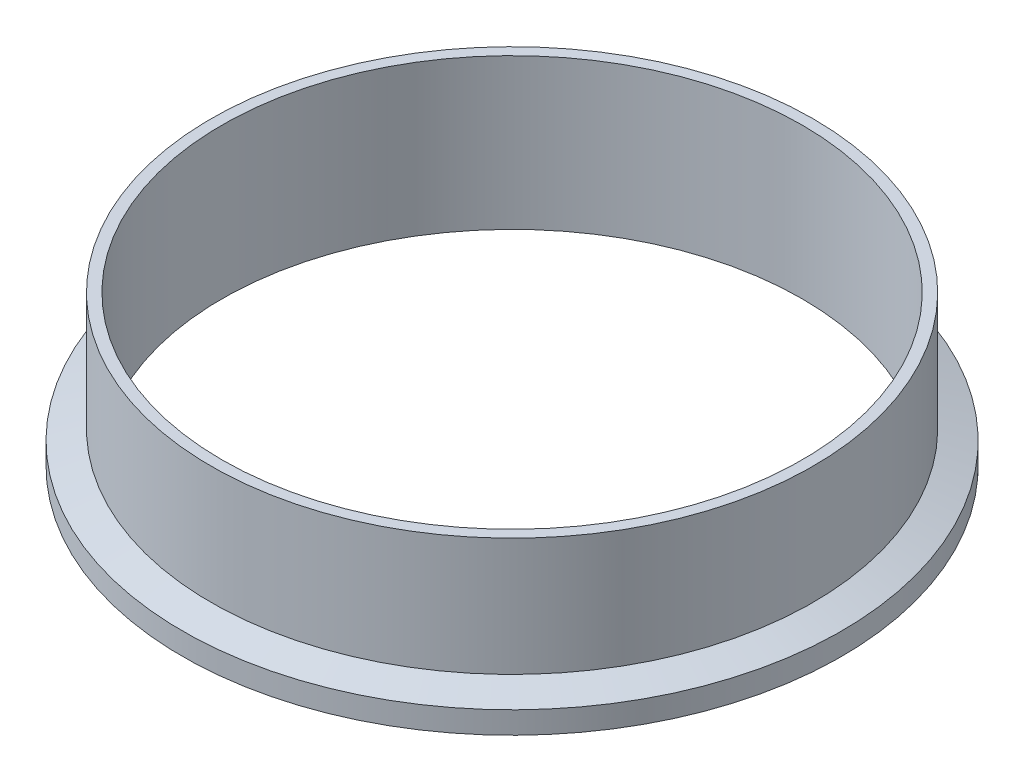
ISO-10303-21;
HEADER;
FILE_DESCRIPTION(('STEP AP214'),'2;1');
FILE_NAME('part.step','',(''),(''),'','','');
FILE_SCHEMA(('AUTOMOTIVE_DESIGN { 1 0 10303 214 1 1 1 1 }'));
ENDSEC;
DATA;
#1=APPLICATION_CONTEXT('core data for automotive mechanical design processes');
#2=APPLICATION_PROTOCOL_DEFINITION('international standard','automotive_design',2000,#1);
#3=PRODUCT_CONTEXT('',#1,'mechanical');
#4=PRODUCT('Part','Part','',(#3));
#5=PRODUCT_RELATED_PRODUCT_CATEGORY('part','',(#4));
#6=PRODUCT_DEFINITION_FORMATION('','',#4);
#7=PRODUCT_DEFINITION_CONTEXT('part definition',#1,'design');
#8=PRODUCT_DEFINITION('design','',#6,#7);
#9=PRODUCT_DEFINITION_SHAPE('','',#8);
#10=(LENGTH_UNIT() NAMED_UNIT(*) SI_UNIT(.MILLI.,.METRE.));
#11=(NAMED_UNIT(*) PLANE_ANGLE_UNIT() SI_UNIT($,.RADIAN.));
#12=(NAMED_UNIT(*) SI_UNIT($,.STERADIAN.) SOLID_ANGLE_UNIT());
#13=UNCERTAINTY_MEASURE_WITH_UNIT(LENGTH_MEASURE(1.E-05),#10,'distance_accuracy_value','');
#14=(GEOMETRIC_REPRESENTATION_CONTEXT(3) GLOBAL_UNCERTAINTY_ASSIGNED_CONTEXT((#13)) GLOBAL_UNIT_ASSIGNED_CONTEXT((#10,
#11,#12)) REPRESENTATION_CONTEXT('',''));
#15=CARTESIAN_POINT('',(0.,0.,0.));
#16=DIRECTION('',(0.,0.,1.));
#17=DIRECTION('',(1.,0.,0.));
#18=AXIS2_PLACEMENT_3D('',#15,#16,#17);
#19=CARTESIAN_POINT('',(0.,0.7874,0.));
#20=DIRECTION('',(0.,-1.,0.));
#21=DIRECTION('',(0.,0.,-1.));
#22=AXIS2_PLACEMENT_3D('',#19,#20,#21);
#23=TOROIDAL_SURFACE('',#22,79.9992084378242,0.787400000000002);
#24=CARTESIAN_POINT('',(0.,0.,0.));
#25=DIRECTION('',(0.,-1.,0.));
#26=DIRECTION('',(0.,0.,-1.));
#27=AXIS2_PLACEMENT_3D('',#24,#25,#26);
#28=CIRCLE('',#27,79.9992084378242);
#29=CARTESIAN_POINT('',(0.,0.,-79.9992084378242));
#30=VERTEX_POINT('',#29);
#31=EDGE_CURVE('E67',#30,#30,#28,.T.);
#32=ORIENTED_EDGE('',*,*,#31,.T.);
#33=EDGE_LOOP('',(#32));
#34=FACE_BOUND('',#33,.T.);
#35=CARTESIAN_POINT('',(0.,0.474458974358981,0.));
#36=DIRECTION('',(0.,-1.,0.));
#37=DIRECTION('',(0.,0.,-1.));
#38=AXIS2_PLACEMENT_3D('',#35,#36,#37);
#39=CIRCLE('',#38,79.2766666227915);
#40=CARTESIAN_POINT('',(0.,0.474458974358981,-79.2766666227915));
#41=VERTEX_POINT('',#40);
#42=EDGE_CURVE('E10',#41,#41,#39,.T.);
#43=ORIENTED_EDGE('',*,*,#42,.F.);
#44=EDGE_LOOP('',(#43));
#45=FACE_BOUND('',#44,.T.);
#46=ADVANCED_FACE('F33',(#34,#45),#23,.T.);
#47=CARTESIAN_POINT('',(0.,0.,0.));
#48=DIRECTION('',(0.,-1.,0.));
#49=DIRECTION('',(0.,0.,-1.));
#50=AXIS2_PLACEMENT_3D('',#47,#48,#49);
#51=TOROIDAL_SURFACE('',#50,78.1812,1.1938);
#52=CARTESIAN_POINT('',(0.,0.474458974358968,0.));
#53=DIRECTION('',(0.,-1.,0.));
#54=DIRECTION('',(0.,0.,-1.));
#55=AXIS2_PLACEMENT_3D('',#52,#53,#54);
#56=CIRCLE('',#55,77.0857333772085);
#57=CARTESIAN_POINT('',(0.,0.474458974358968,-77.0857333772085));
#58=VERTEX_POINT('',#57);
#59=EDGE_CURVE('E39',#58,#58,#56,.T.);
#60=ORIENTED_EDGE('',*,*,#59,.F.);
#61=EDGE_LOOP('',(#60));
#62=FACE_BOUND('',#61,.T.);
#63=ORIENTED_EDGE('',*,*,#42,.T.);
#64=EDGE_LOOP('',(#63));
#65=FACE_BOUND('',#64,.T.);
#66=ADVANCED_FACE('F115',(#62,#65),#51,.F.);
#67=CARTESIAN_POINT('',(0.,0.7874,0.));
#68=DIRECTION('',(0.,-1.,0.));
#69=DIRECTION('',(0.,0.,-1.));
#70=AXIS2_PLACEMENT_3D('',#67,#68,#69);
#71=TOROIDAL_SURFACE('',#70,76.3631915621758,0.787399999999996);
#72=ORIENTED_EDGE('',*,*,#59,.T.);
#73=EDGE_LOOP('',(#72));
#74=FACE_BOUND('',#73,.T.);
#75=CARTESIAN_POINT('',(0.,0.,0.));
#76=DIRECTION('',(0.,-1.,0.));
#77=DIRECTION('',(0.,0.,-1.));
#78=AXIS2_PLACEMENT_3D('',#75,#76,#77);
#79=CIRCLE('',#78,76.3631915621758);
#80=CARTESIAN_POINT('',(0.,0.,-76.3631915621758));
#81=VERTEX_POINT('',#80);
#82=EDGE_CURVE('E43',#81,#81,#79,.T.);
#83=ORIENTED_EDGE('',*,*,#82,.F.);
#84=EDGE_LOOP('',(#83));
#85=FACE_BOUND('',#84,.T.);
#86=ADVANCED_FACE('F111',(#74,#85),#71,.T.);
#87=CARTESIAN_POINT('',(0.,0.,0.));
#88=DIRECTION('',(0.,1.,0.));
#89=DIRECTION('',(0.,0.,1.));
#90=AXIS2_PLACEMENT_3D('',#87,#88,#89);
#91=PLANE('',#90);
#92=CARTESIAN_POINT('',(0.,0.,0.));
#93=DIRECTION('',(0.,-1.,0.));
#94=DIRECTION('',(0.,0.,-1.));
#95=AXIS2_PLACEMENT_3D('',#92,#93,#94);
#96=CIRCLE('',#95,73.4314);
#97=CARTESIAN_POINT('',(0.,0.,-73.4314));
#98=VERTEX_POINT('',#97);
#99=EDGE_CURVE('E47',#98,#98,#96,.T.);
#100=ORIENTED_EDGE('',*,*,#99,.F.);
#101=EDGE_LOOP('',(#100));
#102=FACE_BOUND('',#101,.T.);
#103=ORIENTED_EDGE('',*,*,#82,.T.);
#104=EDGE_LOOP('',(#103));
#105=FACE_BOUND('',#104,.T.);
#106=ADVANCED_FACE('F105',(#102,#105),#91,.F.);
#107=CARTESIAN_POINT('',(0.,0.,0.));
#108=DIRECTION('',(0.,-1.,0.));
#109=DIRECTION('',(0.,0.,-1.));
#110=AXIS2_PLACEMENT_3D('',#107,#108,#109);
#111=CYLINDRICAL_SURFACE('',#110,73.4314);
#112=ORIENTED_EDGE('',*,*,#99,.T.);
#113=EDGE_LOOP('',(#112));
#114=FACE_BOUND('',#113,.T.);
#115=CARTESIAN_POINT('',(0.,38.1,0.));
#116=DIRECTION('',(0.,-1.,0.));
#117=DIRECTION('',(0.,0.,-1.));
#118=AXIS2_PLACEMENT_3D('',#115,#116,#117);
#119=CIRCLE('',#118,73.4314);
#120=CARTESIAN_POINT('',(0.,38.1,-73.4314));
#121=VERTEX_POINT('',#120);
#122=EDGE_CURVE('E52',#121,#121,#119,.T.);
#123=ORIENTED_EDGE('',*,*,#122,.F.);
#124=EDGE_LOOP('',(#123));
#125=FACE_BOUND('',#124,.T.);
#126=ADVANCED_FACE('F100',(#114,#125),#111,.F.);
#127=CARTESIAN_POINT('',(0.,38.1,0.));
#128=DIRECTION('',(0.,-1.,0.));
#129=DIRECTION('',(0.,0.,-1.));
#130=AXIS2_PLACEMENT_3D('',#127,#128,#129);
#131=PLANE('',#130);
#132=CARTESIAN_POINT('',(0.,38.1,0.));
#133=DIRECTION('',(0.,-1.,0.));
#134=DIRECTION('',(0.,0.,-1.));
#135=AXIS2_PLACEMENT_3D('',#132,#133,#134);
#136=CIRCLE('',#135,76.2);
#137=CARTESIAN_POINT('',(0.,38.1,-76.2));
#138=VERTEX_POINT('',#137);
#139=EDGE_CURVE('E55',#138,#138,#136,.T.);
#140=ORIENTED_EDGE('',*,*,#139,.F.);
#141=EDGE_LOOP('',(#140));
#142=FACE_BOUND('',#141,.T.);
#143=ORIENTED_EDGE('',*,*,#122,.T.);
#144=EDGE_LOOP('',(#143));
#145=FACE_BOUND('',#144,.T.);
#146=ADVANCED_FACE('F94',(#142,#145),#131,.F.);
#147=CARTESIAN_POINT('',(0.,0.,0.));
#148=DIRECTION('',(0.,-1.,0.));
#149=DIRECTION('',(0.,0.,-1.));
#150=AXIS2_PLACEMENT_3D('',#147,#148,#149);
#151=CYLINDRICAL_SURFACE('',#150,76.2);
#152=CARTESIAN_POINT('',(0.,8.22278052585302,0.));
#153=DIRECTION('',(0.,-1.,0.));
#154=DIRECTION('',(0.,0.,-1.));
#155=AXIS2_PLACEMENT_3D('',#152,#153,#154);
#156=CIRCLE('',#155,76.2);
#157=CARTESIAN_POINT('',(0.,8.22278052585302,-76.2));
#158=VERTEX_POINT('',#157);
#159=EDGE_CURVE('E58',#158,#158,#156,.T.);
#160=ORIENTED_EDGE('',*,*,#159,.F.);
#161=EDGE_LOOP('',(#160));
#162=FACE_BOUND('',#161,.T.);
#163=ORIENTED_EDGE('',*,*,#139,.T.);
#164=EDGE_LOOP('',(#163));
#165=FACE_BOUND('',#164,.T.);
#166=ADVANCED_FACE('F88',(#162,#165),#151,.T.);
#167=CARTESIAN_POINT('',(0.,8.22278052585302,0.));
#168=DIRECTION('',(0.,-1.,0.));
#169=DIRECTION('',(0.,0.,-1.));
#170=AXIS2_PLACEMENT_3D('',#167,#168,#169);
#171=CONICAL_SURFACE('',#170,76.2,1.22173047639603);
#172=CARTESIAN_POINT('',(0.,5.588,0.));
#173=DIRECTION('',(0.,-1.,0.));
#174=DIRECTION('',(0.,0.,-1.));
#175=AXIS2_PLACEMENT_3D('',#172,#173,#174);
#176=CIRCLE('',#175,83.439);
#177=CARTESIAN_POINT('',(0.,5.588,-83.439));
#178=VERTEX_POINT('',#177);
#179=EDGE_CURVE('E61',#178,#178,#176,.T.);
#180=ORIENTED_EDGE('',*,*,#179,.F.);
#181=EDGE_LOOP('',(#180));
#182=FACE_BOUND('',#181,.T.);
#183=ORIENTED_EDGE('',*,*,#159,.T.);
#184=EDGE_LOOP('',(#183));
#185=FACE_BOUND('',#184,.T.);
#186=ADVANCED_FACE('F82',(#182,#185),#171,.T.);
#187=CARTESIAN_POINT('',(0.,0.,0.));
#188=DIRECTION('',(0.,-1.,0.));
#189=DIRECTION('',(0.,0.,-1.));
#190=AXIS2_PLACEMENT_3D('',#187,#188,#189);
#191=CYLINDRICAL_SURFACE('',#190,83.439);
#192=CARTESIAN_POINT('',(0.,0.,0.));
#193=DIRECTION('',(0.,-1.,0.));
#194=DIRECTION('',(0.,0.,-1.));
#195=AXIS2_PLACEMENT_3D('',#192,#193,#194);
#196=CIRCLE('',#195,83.439);
#197=CARTESIAN_POINT('',(0.,0.,-83.439));
#198=VERTEX_POINT('',#197);
#199=EDGE_CURVE('E64',#198,#198,#196,.T.);
#200=ORIENTED_EDGE('',*,*,#199,.F.);
#201=EDGE_LOOP('',(#200));
#202=FACE_BOUND('',#201,.T.);
#203=ORIENTED_EDGE('',*,*,#179,.T.);
#204=EDGE_LOOP('',(#203));
#205=FACE_BOUND('',#204,.T.);
#206=ADVANCED_FACE('F76',(#202,#205),#191,.T.);
#207=CARTESIAN_POINT('',(0.,0.,0.));
#208=DIRECTION('',(0.,1.,0.));
#209=DIRECTION('',(0.,0.,1.));
#210=AXIS2_PLACEMENT_3D('',#207,#208,#209);
#211=PLANE('',#210);
#212=ORIENTED_EDGE('',*,*,#31,.F.);
#213=EDGE_LOOP('',(#212));
#214=FACE_BOUND('',#213,.T.);
#215=ORIENTED_EDGE('',*,*,#199,.T.);
#216=EDGE_LOOP('',(#215));
#217=FACE_BOUND('',#216,.T.);
#218=ADVANCED_FACE('F73',(#214,#217),#211,.F.);
#219=CLOSED_SHELL('',(#46,#66,#86,#106,#126,#146,#166,#186,#206,#218));
#220=MANIFOLD_SOLID_BREP('B2',#219);
#221=ADVANCED_BREP_SHAPE_REPRESENTATION('',(#18,#220),#14);
#222=SHAPE_DEFINITION_REPRESENTATION(#9,#221);
ENDSEC;
END-ISO-10303-21;
